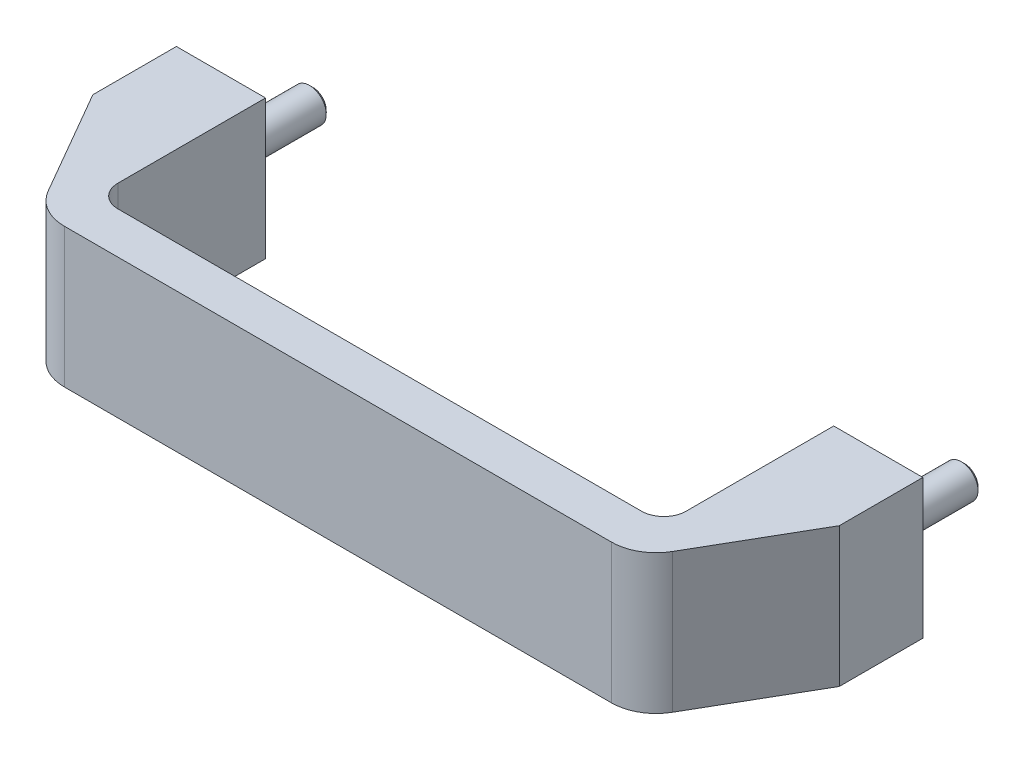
ISO-10303-21;
HEADER;
FILE_DESCRIPTION(('STEP AP214'),'2;1');
FILE_NAME('part.step','',(''),(''),'','','');
FILE_SCHEMA(('AUTOMOTIVE_DESIGN { 1 0 10303 214 1 1 1 1 }'));
ENDSEC;
DATA;
#1=APPLICATION_CONTEXT('core data for automotive mechanical design processes');
#2=APPLICATION_PROTOCOL_DEFINITION('international standard','automotive_design',2000,#1);
#3=PRODUCT_CONTEXT('',#1,'mechanical');
#4=PRODUCT('Part','Part','',(#3));
#5=PRODUCT_RELATED_PRODUCT_CATEGORY('part','',(#4));
#6=PRODUCT_DEFINITION_FORMATION('','',#4);
#7=PRODUCT_DEFINITION_CONTEXT('part definition',#1,'design');
#8=PRODUCT_DEFINITION('design','',#6,#7);
#9=PRODUCT_DEFINITION_SHAPE('','',#8);
#10=(LENGTH_UNIT() NAMED_UNIT(*) SI_UNIT(.MILLI.,.METRE.));
#11=(NAMED_UNIT(*) PLANE_ANGLE_UNIT() SI_UNIT($,.RADIAN.));
#12=(NAMED_UNIT(*) SI_UNIT($,.STERADIAN.) SOLID_ANGLE_UNIT());
#13=UNCERTAINTY_MEASURE_WITH_UNIT(LENGTH_MEASURE(1.E-05),#10,'distance_accuracy_value','');
#14=(GEOMETRIC_REPRESENTATION_CONTEXT(3) GLOBAL_UNCERTAINTY_ASSIGNED_CONTEXT((#13)) GLOBAL_UNIT_ASSIGNED_CONTEXT((#10,
#11,#12)) REPRESENTATION_CONTEXT('',''));
#15=CARTESIAN_POINT('',(0.,0.,0.));
#16=DIRECTION('',(0.,0.,1.));
#17=DIRECTION('',(1.,0.,0.));
#18=AXIS2_PLACEMENT_3D('',#15,#16,#17);
#19=CARTESIAN_POINT('',(2.4696551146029,-12.5,34.));
#20=DIRECTION('',(0.866025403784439,0.,-0.5));
#21=DIRECTION('',(0.5,0.,0.866025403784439));
#22=AXIS2_PLACEMENT_3D('',#19,#20,#21);
#23=PLANE('',#22);
#24=DIRECTION('',(-0.5,0.,-0.866025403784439));
#25=VECTOR('',#24,1.);
#26=CARTESIAN_POINT('',(2.4696551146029,12.5,34.));
#27=LINE('',#26,#25);
#28=CARTESIAN_POINT('',(2.4696551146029,12.5,34.));
#29=VERTEX_POINT('',#28);
#30=CARTESIAN_POINT('',(-8.5,12.5,15.));
#31=VERTEX_POINT('',#30);
#32=EDGE_CURVE('E148',#29,#31,#27,.T.);
#33=ORIENTED_EDGE('',*,*,#32,.T.);
#34=DIRECTION('',(0.,1.,0.));
#35=VECTOR('',#34,1.);
#36=CARTESIAN_POINT('',(-8.5,-12.5,15.));
#37=LINE('',#36,#35);
#38=CARTESIAN_POINT('',(-8.5,-12.5,15.));
#39=VERTEX_POINT('',#38);
#40=EDGE_CURVE('E205',#39,#31,#37,.T.);
#41=ORIENTED_EDGE('',*,*,#40,.F.);
#42=DIRECTION('',(-0.5,0.,-0.866025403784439));
#43=VECTOR('',#42,1.);
#44=CARTESIAN_POINT('',(2.4696551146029,-12.5,34.));
#45=LINE('',#44,#43);
#46=CARTESIAN_POINT('',(2.4696551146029,-12.5,34.));
#47=VERTEX_POINT('',#46);
#48=EDGE_CURVE('E178',#47,#39,#45,.T.);
#49=ORIENTED_EDGE('',*,*,#48,.F.);
#50=DIRECTION('',(0.,1.,0.));
#51=VECTOR('',#50,1.);
#52=CARTESIAN_POINT('',(2.4696551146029,-12.5,34.));
#53=LINE('',#52,#51);
#54=EDGE_CURVE('E144',#47,#29,#53,.T.);
#55=ORIENTED_EDGE('',*,*,#54,.T.);
#56=EDGE_LOOP('',(#33,#41,#49,#55));
#57=FACE_BOUND('',#56,.T.);
#58=ADVANCED_FACE('F14',(#57),#23,.F.);
#59=CARTESIAN_POINT('',(-8.5,-12.5,15.));
#60=DIRECTION('',(1.,0.,0.));
#61=DIRECTION('',(0.,1.,0.));
#62=AXIS2_PLACEMENT_3D('',#59,#60,#61);
#63=PLANE('',#62);
#64=DIRECTION('',(0.,0.,-1.));
#65=VECTOR('',#64,1.);
#66=CARTESIAN_POINT('',(-8.5,12.5,15.));
#67=LINE('',#66,#65);
#68=CARTESIAN_POINT('',(-8.5,12.5,0.));
#69=VERTEX_POINT('',#68);
#70=EDGE_CURVE('E151',#31,#69,#67,.T.);
#71=ORIENTED_EDGE('',*,*,#70,.T.);
#72=DIRECTION('',(0.,1.,0.));
#73=VECTOR('',#72,1.);
#74=CARTESIAN_POINT('',(-8.5,-12.5,0.));
#75=LINE('',#74,#73);
#76=CARTESIAN_POINT('',(-8.5,-12.5,0.));
#77=VERTEX_POINT('',#76);
#78=EDGE_CURVE('E202',#77,#69,#75,.T.);
#79=ORIENTED_EDGE('',*,*,#78,.F.);
#80=DIRECTION('',(0.,0.,-1.));
#81=VECTOR('',#80,1.);
#82=CARTESIAN_POINT('',(-8.5,-12.5,15.));
#83=LINE('',#82,#81);
#84=EDGE_CURVE('E93',#39,#77,#83,.T.);
#85=ORIENTED_EDGE('',*,*,#84,.F.);
#86=ORIENTED_EDGE('',*,*,#40,.T.);
#87=EDGE_LOOP('',(#71,#79,#85,#86));
#88=FACE_BOUND('',#87,.T.);
#89=ADVANCED_FACE('F234',(#88),#63,.F.);
#90=CARTESIAN_POINT('',(-8.5,-12.5,0.));
#91=DIRECTION('',(0.,0.,1.));
#92=DIRECTION('',(0.,-1.,0.));
#93=AXIS2_PLACEMENT_3D('',#90,#91,#92);
#94=PLANE('',#93);
#95=CARTESIAN_POINT('',(0.,0.,0.));
#96=DIRECTION('',(0.,0.,1.));
#97=DIRECTION('',(0.,-1.,0.));
#98=AXIS2_PLACEMENT_3D('',#95,#96,#97);
#99=CIRCLE('',#98,3.);
#100=CARTESIAN_POINT('',(0.,-3.,0.));
#101=VERTEX_POINT('',#100);
#102=EDGE_CURVE('E207',#101,#101,#99,.F.);
#103=ORIENTED_EDGE('',*,*,#102,.F.);
#104=EDGE_LOOP('',(#103));
#105=FACE_BOUND('',#104,.T.);
#106=DIRECTION('',(1.,0.,0.));
#107=VECTOR('',#106,1.);
#108=CARTESIAN_POINT('',(-8.5,12.5,0.));
#109=LINE('',#108,#107);
#110=CARTESIAN_POINT('',(7.5,12.5,0.));
#111=VERTEX_POINT('',#110);
#112=EDGE_CURVE('E153',#69,#111,#109,.T.);
#113=ORIENTED_EDGE('',*,*,#112,.T.);
#114=DIRECTION('',(0.,1.,0.));
#115=VECTOR('',#114,1.);
#116=CARTESIAN_POINT('',(7.5,-12.5,0.));
#117=LINE('',#116,#115);
#118=CARTESIAN_POINT('',(7.5,-12.5,0.));
#119=VERTEX_POINT('',#118);
#120=EDGE_CURVE('E199',#119,#111,#117,.T.);
#121=ORIENTED_EDGE('',*,*,#120,.F.);
#122=DIRECTION('',(1.,0.,0.));
#123=VECTOR('',#122,1.);
#124=CARTESIAN_POINT('',(-8.5,-12.5,0.));
#125=LINE('',#124,#123);
#126=EDGE_CURVE('E470',#77,#119,#125,.T.);
#127=ORIENTED_EDGE('',*,*,#126,.F.);
#128=ORIENTED_EDGE('',*,*,#78,.T.);
#129=EDGE_LOOP('',(#113,#121,#127,#128));
#130=FACE_BOUND('',#129,.T.);
#131=ADVANCED_FACE('F240',(#105,#130),#94,.F.);
#132=CARTESIAN_POINT('',(7.5,-12.5,0.));
#133=DIRECTION('',(-1.,0.,0.));
#134=DIRECTION('',(0.,-1.,0.));
#135=AXIS2_PLACEMENT_3D('',#132,#133,#134);
#136=PLANE('',#135);
#137=DIRECTION('',(0.,0.,1.));
#138=VECTOR('',#137,1.);
#139=CARTESIAN_POINT('',(7.5,12.5,0.));
#140=LINE('',#139,#138);
#141=CARTESIAN_POINT('',(7.5,12.5,26.5));
#142=VERTEX_POINT('',#141);
#143=EDGE_CURVE('E155',#111,#142,#140,.T.);
#144=ORIENTED_EDGE('',*,*,#143,.T.);
#145=DIRECTION('',(0.,1.,0.));
#146=VECTOR('',#145,1.);
#147=CARTESIAN_POINT('',(7.5,-12.5,26.5));
#148=LINE('',#147,#146);
#149=CARTESIAN_POINT('',(7.5,-12.5,26.5));
#150=VERTEX_POINT('',#149);
#151=EDGE_CURVE('E197',#150,#142,#148,.T.);
#152=ORIENTED_EDGE('',*,*,#151,.F.);
#153=DIRECTION('',(0.,0.,1.));
#154=VECTOR('',#153,1.);
#155=CARTESIAN_POINT('',(7.5,-12.5,0.));
#156=LINE('',#155,#154);
#157=EDGE_CURVE('E468',#119,#150,#156,.T.);
#158=ORIENTED_EDGE('',*,*,#157,.F.);
#159=ORIENTED_EDGE('',*,*,#120,.T.);
#160=EDGE_LOOP('',(#144,#152,#158,#159));
#161=FACE_BOUND('',#160,.T.);
#162=ADVANCED_FACE('F245',(#161),#136,.F.);
#163=CARTESIAN_POINT('',(11.5,-12.5,26.5));
#164=DIRECTION('',(0.,1.,0.));
#165=DIRECTION('',(-1.,0.,0.));
#166=AXIS2_PLACEMENT_3D('',#163,#164,#165);
#167=CYLINDRICAL_SURFACE('',#166,4.);
#168=CARTESIAN_POINT('',(11.5,12.5,26.5));
#169=DIRECTION('',(0.,-1.,0.));
#170=DIRECTION('',(1.,0.,0.));
#171=AXIS2_PLACEMENT_3D('',#168,#169,#170);
#172=CIRCLE('',#171,4.);
#173=CARTESIAN_POINT('',(11.5,12.5,30.5));
#174=VERTEX_POINT('',#173);
#175=EDGE_CURVE('E158',#174,#142,#172,.T.);
#176=ORIENTED_EDGE('',*,*,#175,.F.);
#177=DIRECTION('',(0.,1.,0.));
#178=VECTOR('',#177,1.);
#179=CARTESIAN_POINT('',(11.5,-12.5,30.5));
#180=LINE('',#179,#178);
#181=CARTESIAN_POINT('',(11.5,-12.5,30.5));
#182=VERTEX_POINT('',#181);
#183=EDGE_CURVE('E195',#182,#174,#180,.T.);
#184=ORIENTED_EDGE('',*,*,#183,.F.);
#185=CARTESIAN_POINT('',(11.5,-12.5,26.5));
#186=DIRECTION('',(0.,-1.,0.));
#187=DIRECTION('',(1.,0.,0.));
#188=AXIS2_PLACEMENT_3D('',#185,#186,#187);
#189=CIRCLE('',#188,4.);
#190=EDGE_CURVE('E465',#182,#150,#189,.T.);
#191=ORIENTED_EDGE('',*,*,#190,.T.);
#192=ORIENTED_EDGE('',*,*,#151,.T.);
#193=EDGE_LOOP('',(#176,#184,#191,#192));
#194=FACE_BOUND('',#193,.T.);
#195=ADVANCED_FACE('F249',(#194),#167,.F.);
#196=CARTESIAN_POINT('',(11.5,-12.5,30.5));
#197=DIRECTION('',(0.,0.,1.));
#198=DIRECTION('',(0.,-1.,0.));
#199=AXIS2_PLACEMENT_3D('',#196,#197,#198);
#200=PLANE('',#199);
#201=DIRECTION('',(1.,0.,0.));
#202=VECTOR('',#201,1.);
#203=CARTESIAN_POINT('',(11.5,12.5,30.5));
#204=LINE('',#203,#202);
#205=CARTESIAN_POINT('',(105.5,12.5,30.5));
#206=VERTEX_POINT('',#205);
#207=EDGE_CURVE('E161',#174,#206,#204,.T.);
#208=ORIENTED_EDGE('',*,*,#207,.T.);
#209=DIRECTION('',(0.,1.,0.));
#210=VECTOR('',#209,1.);
#211=CARTESIAN_POINT('',(105.5,-12.5,30.5));
#212=LINE('',#211,#210);
#213=CARTESIAN_POINT('',(105.5,-12.5,30.5));
#214=VERTEX_POINT('',#213);
#215=EDGE_CURVE('E193',#214,#206,#212,.T.);
#216=ORIENTED_EDGE('',*,*,#215,.F.);
#217=DIRECTION('',(1.,0.,0.));
#218=VECTOR('',#217,1.);
#219=CARTESIAN_POINT('',(11.5,-12.5,30.5));
#220=LINE('',#219,#218);
#221=EDGE_CURVE('E463',#182,#214,#220,.T.);
#222=ORIENTED_EDGE('',*,*,#221,.F.);
#223=ORIENTED_EDGE('',*,*,#183,.T.);
#224=EDGE_LOOP('',(#208,#216,#222,#223));
#225=FACE_BOUND('',#224,.T.);
#226=ADVANCED_FACE('F253',(#225),#200,.F.);
#227=CARTESIAN_POINT('',(105.5,-12.5,26.5));
#228=DIRECTION('',(0.,1.,0.));
#229=DIRECTION('',(-1.,0.,0.));
#230=AXIS2_PLACEMENT_3D('',#227,#228,#229);
#231=CYLINDRICAL_SURFACE('',#230,4.);
#232=CARTESIAN_POINT('',(105.5,12.5,26.5));
#233=DIRECTION('',(0.,-1.,0.));
#234=DIRECTION('',(1.,0.,0.));
#235=AXIS2_PLACEMENT_3D('',#232,#233,#234);
#236=CIRCLE('',#235,4.);
#237=CARTESIAN_POINT('',(109.5,12.5,26.5));
#238=VERTEX_POINT('',#237);
#239=EDGE_CURVE('E164',#238,#206,#236,.T.);
#240=ORIENTED_EDGE('',*,*,#239,.F.);
#241=DIRECTION('',(0.,1.,0.));
#242=VECTOR('',#241,1.);
#243=CARTESIAN_POINT('',(109.5,-12.5,26.5));
#244=LINE('',#243,#242);
#245=CARTESIAN_POINT('',(109.5,-12.5,26.5));
#246=VERTEX_POINT('',#245);
#247=EDGE_CURVE('E191',#246,#238,#244,.T.);
#248=ORIENTED_EDGE('',*,*,#247,.F.);
#249=CARTESIAN_POINT('',(105.5,-12.5,26.5));
#250=DIRECTION('',(0.,-1.,0.));
#251=DIRECTION('',(1.,0.,0.));
#252=AXIS2_PLACEMENT_3D('',#249,#250,#251);
#253=CIRCLE('',#252,4.);
#254=EDGE_CURVE('E460',#246,#214,#253,.T.);
#255=ORIENTED_EDGE('',*,*,#254,.T.);
#256=ORIENTED_EDGE('',*,*,#215,.T.);
#257=EDGE_LOOP('',(#240,#248,#255,#256));
#258=FACE_BOUND('',#257,.T.);
#259=ADVANCED_FACE('F257',(#258),#231,.F.);
#260=CARTESIAN_POINT('',(109.5,-12.5,26.5));
#261=DIRECTION('',(1.,0.,0.));
#262=DIRECTION('',(0.,1.,0.));
#263=AXIS2_PLACEMENT_3D('',#260,#261,#262);
#264=PLANE('',#263);
#265=DIRECTION('',(0.,0.,-1.));
#266=VECTOR('',#265,1.);
#267=CARTESIAN_POINT('',(109.5,12.5,26.5));
#268=LINE('',#267,#266);
#269=CARTESIAN_POINT('',(109.5,12.5,0.));
#270=VERTEX_POINT('',#269);
#271=EDGE_CURVE('E167',#238,#270,#268,.T.);
#272=ORIENTED_EDGE('',*,*,#271,.T.);
#273=DIRECTION('',(0.,1.,0.));
#274=VECTOR('',#273,1.);
#275=CARTESIAN_POINT('',(109.5,-12.5,0.));
#276=LINE('',#275,#274);
#277=CARTESIAN_POINT('',(109.5,-12.5,0.));
#278=VERTEX_POINT('',#277);
#279=EDGE_CURVE('E188',#278,#270,#276,.T.);
#280=ORIENTED_EDGE('',*,*,#279,.F.);
#281=DIRECTION('',(0.,0.,-1.));
#282=VECTOR('',#281,1.);
#283=CARTESIAN_POINT('',(109.5,-12.5,26.5));
#284=LINE('',#283,#282);
#285=EDGE_CURVE('E458',#246,#278,#284,.T.);
#286=ORIENTED_EDGE('',*,*,#285,.F.);
#287=ORIENTED_EDGE('',*,*,#247,.T.);
#288=EDGE_LOOP('',(#272,#280,#286,#287));
#289=FACE_BOUND('',#288,.T.);
#290=ADVANCED_FACE('F261',(#289),#264,.F.);
#291=CARTESIAN_POINT('',(109.5,-12.5,0.));
#292=DIRECTION('',(0.,0.,1.));
#293=DIRECTION('',(0.,-1.,0.));
#294=AXIS2_PLACEMENT_3D('',#291,#292,#293);
#295=PLANE('',#294);
#296=CARTESIAN_POINT('',(117.,0.,0.));
#297=DIRECTION('',(0.,0.,1.));
#298=DIRECTION('',(0.,-1.,0.));
#299=AXIS2_PLACEMENT_3D('',#296,#297,#298);
#300=CIRCLE('',#299,3.);
#301=CARTESIAN_POINT('',(117.,-3.,0.));
#302=VERTEX_POINT('',#301);
#303=EDGE_CURVE('E210',#302,#302,#300,.F.);
#304=ORIENTED_EDGE('',*,*,#303,.F.);
#305=EDGE_LOOP('',(#304));
#306=FACE_BOUND('',#305,.T.);
#307=DIRECTION('',(1.,0.,0.));
#308=VECTOR('',#307,1.);
#309=CARTESIAN_POINT('',(109.5,12.5,0.));
#310=LINE('',#309,#308);
#311=CARTESIAN_POINT('',(125.5,12.5,0.));
#312=VERTEX_POINT('',#311);
#313=EDGE_CURVE('E169',#270,#312,#310,.T.);
#314=ORIENTED_EDGE('',*,*,#313,.T.);
#315=DIRECTION('',(0.,1.,0.));
#316=VECTOR('',#315,1.);
#317=CARTESIAN_POINT('',(125.5,-12.5,0.));
#318=LINE('',#317,#316);
#319=CARTESIAN_POINT('',(125.5,-12.5,0.));
#320=VERTEX_POINT('',#319);
#321=EDGE_CURVE('E185',#320,#312,#318,.T.);
#322=ORIENTED_EDGE('',*,*,#321,.F.);
#323=DIRECTION('',(1.,0.,0.));
#324=VECTOR('',#323,1.);
#325=CARTESIAN_POINT('',(109.5,-12.5,0.));
#326=LINE('',#325,#324);
#327=EDGE_CURVE('E454',#278,#320,#326,.T.);
#328=ORIENTED_EDGE('',*,*,#327,.F.);
#329=ORIENTED_EDGE('',*,*,#279,.T.);
#330=EDGE_LOOP('',(#314,#322,#328,#329));
#331=FACE_BOUND('',#330,.T.);
#332=ADVANCED_FACE('F265',(#306,#331),#295,.F.);
#333=CARTESIAN_POINT('',(125.5,-12.5,0.));
#334=DIRECTION('',(-1.,0.,0.));
#335=DIRECTION('',(0.,-1.,0.));
#336=AXIS2_PLACEMENT_3D('',#333,#334,#335);
#337=PLANE('',#336);
#338=DIRECTION('',(0.,0.,1.));
#339=VECTOR('',#338,1.);
#340=CARTESIAN_POINT('',(125.5,12.5,0.));
#341=LINE('',#340,#339);
#342=CARTESIAN_POINT('',(125.5,12.5,15.));
#343=VERTEX_POINT('',#342);
#344=EDGE_CURVE('E171',#312,#343,#341,.T.);
#345=ORIENTED_EDGE('',*,*,#344,.T.);
#346=DIRECTION('',(0.,1.,0.));
#347=VECTOR('',#346,1.);
#348=CARTESIAN_POINT('',(125.5,-12.5,15.));
#349=LINE('',#348,#347);
#350=CARTESIAN_POINT('',(125.5,-12.5,15.));
#351=VERTEX_POINT('',#350);
#352=EDGE_CURVE('E182',#351,#343,#349,.T.);
#353=ORIENTED_EDGE('',*,*,#352,.F.);
#354=DIRECTION('',(0.,0.,1.));
#355=VECTOR('',#354,1.);
#356=CARTESIAN_POINT('',(125.5,-12.5,0.));
#357=LINE('',#356,#355);
#358=EDGE_CURVE('E451',#320,#351,#357,.T.);
#359=ORIENTED_EDGE('',*,*,#358,.F.);
#360=ORIENTED_EDGE('',*,*,#321,.T.);
#361=EDGE_LOOP('',(#345,#353,#359,#360));
#362=FACE_BOUND('',#361,.T.);
#363=ADVANCED_FACE('F269',(#362),#337,.F.);
#364=CARTESIAN_POINT('',(125.5,-12.5,15.));
#365=DIRECTION('',(-0.866025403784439,0.,-0.5));
#366=DIRECTION('',(0.5,0.,-0.866025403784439));
#367=AXIS2_PLACEMENT_3D('',#364,#365,#366);
#368=PLANE('',#367);
#369=DIRECTION('',(-0.5,0.,0.866025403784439));
#370=VECTOR('',#369,1.);
#371=CARTESIAN_POINT('',(125.5,12.5,15.));
#372=LINE('',#371,#370);
#373=CARTESIAN_POINT('',(114.530344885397,12.5,34.));
#374=VERTEX_POINT('',#373);
#375=EDGE_CURVE('E173',#343,#374,#372,.T.);
#376=ORIENTED_EDGE('',*,*,#375,.T.);
#377=DIRECTION('',(0.,1.,0.));
#378=VECTOR('',#377,1.);
#379=CARTESIAN_POINT('',(114.530344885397,-12.5,34.));
#380=LINE('',#379,#378);
#381=CARTESIAN_POINT('',(114.530344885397,-12.5,34.));
#382=VERTEX_POINT('',#381);
#383=EDGE_CURVE('E139',#382,#374,#380,.T.);
#384=ORIENTED_EDGE('',*,*,#383,.F.);
#385=DIRECTION('',(-0.5,0.,0.866025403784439));
#386=VECTOR('',#385,1.);
#387=CARTESIAN_POINT('',(125.5,-12.5,15.));
#388=LINE('',#387,#386);
#389=EDGE_CURVE('E130',#351,#382,#388,.T.);
#390=ORIENTED_EDGE('',*,*,#389,.F.);
#391=ORIENTED_EDGE('',*,*,#352,.T.);
#392=EDGE_LOOP('',(#376,#384,#390,#391));
#393=FACE_BOUND('',#392,.T.);
#394=ADVANCED_FACE('F273',(#393),#368,.F.);
#395=CARTESIAN_POINT('',(107.602141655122,-12.5,30.));
#396=DIRECTION('',(0.,1.,0.));
#397=DIRECTION('',(-1.,0.,0.));
#398=AXIS2_PLACEMENT_3D('',#395,#396,#397);
#399=CYLINDRICAL_SURFACE('',#398,8.);
#400=CARTESIAN_POINT('',(107.602141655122,12.5,30.));
#401=DIRECTION('',(0.,-1.,0.));
#402=DIRECTION('',(1.,0.,0.));
#403=AXIS2_PLACEMENT_3D('',#400,#401,#402);
#404=CIRCLE('',#403,8.);
#405=CARTESIAN_POINT('',(107.602141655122,12.5,38.));
#406=VERTEX_POINT('',#405);
#407=EDGE_CURVE('E138',#374,#406,#404,.T.);
#408=ORIENTED_EDGE('',*,*,#407,.T.);
#409=DIRECTION('',(0.,1.,0.));
#410=VECTOR('',#409,1.);
#411=CARTESIAN_POINT('',(107.602141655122,-12.5,38.));
#412=LINE('',#411,#410);
#413=CARTESIAN_POINT('',(107.602141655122,-12.5,38.));
#414=VERTEX_POINT('',#413);
#415=EDGE_CURVE('E135',#414,#406,#412,.T.);
#416=ORIENTED_EDGE('',*,*,#415,.F.);
#417=CARTESIAN_POINT('',(107.602141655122,-12.5,30.));
#418=DIRECTION('',(0.,-1.,0.));
#419=DIRECTION('',(1.,0.,0.));
#420=AXIS2_PLACEMENT_3D('',#417,#418,#419);
#421=CIRCLE('',#420,8.);
#422=EDGE_CURVE('E124',#382,#414,#421,.T.);
#423=ORIENTED_EDGE('',*,*,#422,.F.);
#424=ORIENTED_EDGE('',*,*,#383,.T.);
#425=EDGE_LOOP('',(#408,#416,#423,#424));
#426=FACE_BOUND('',#425,.T.);
#427=ADVANCED_FACE('F136',(#426),#399,.T.);
#428=CARTESIAN_POINT('',(107.602141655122,-12.5,38.));
#429=DIRECTION('',(0.,0.,-1.));
#430=DIRECTION('',(0.,1.,0.));
#431=AXIS2_PLACEMENT_3D('',#428,#429,#430);
#432=PLANE('',#431);
#433=DIRECTION('',(-1.,0.,0.));
#434=VECTOR('',#433,1.);
#435=CARTESIAN_POINT('',(107.602141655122,12.5,38.));
#436=LINE('',#435,#434);
#437=CARTESIAN_POINT('',(9.3978583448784,12.5,38.));
#438=VERTEX_POINT('',#437);
#439=EDGE_CURVE('E78',#406,#438,#436,.T.);
#440=ORIENTED_EDGE('',*,*,#439,.T.);
#441=DIRECTION('',(0.,1.,0.));
#442=VECTOR('',#441,1.);
#443=CARTESIAN_POINT('',(9.3978583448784,-12.5,38.));
#444=LINE('',#443,#442);
#445=CARTESIAN_POINT('',(9.3978583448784,-12.5,38.));
#446=VERTEX_POINT('',#445);
#447=EDGE_CURVE('E140',#446,#438,#444,.T.);
#448=ORIENTED_EDGE('',*,*,#447,.F.);
#449=DIRECTION('',(-1.,0.,0.));
#450=VECTOR('',#449,1.);
#451=CARTESIAN_POINT('',(107.602141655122,-12.5,38.));
#452=LINE('',#451,#450);
#453=EDGE_CURVE('E128',#414,#446,#452,.T.);
#454=ORIENTED_EDGE('',*,*,#453,.F.);
#455=ORIENTED_EDGE('',*,*,#415,.T.);
#456=EDGE_LOOP('',(#440,#448,#454,#455));
#457=FACE_BOUND('',#456,.T.);
#458=ADVANCED_FACE('F142',(#457),#432,.F.);
#459=CARTESIAN_POINT('',(9.3978583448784,-12.5,30.));
#460=DIRECTION('',(0.,1.,0.));
#461=DIRECTION('',(-1.,0.,0.));
#462=AXIS2_PLACEMENT_3D('',#459,#460,#461);
#463=CYLINDRICAL_SURFACE('',#462,8.);
#464=CARTESIAN_POINT('',(9.3978583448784,12.5,30.));
#465=DIRECTION('',(0.,-1.,0.));
#466=DIRECTION('',(1.,0.,0.));
#467=AXIS2_PLACEMENT_3D('',#464,#465,#466);
#468=CIRCLE('',#467,8.);
#469=EDGE_CURVE('E84',#438,#29,#468,.T.);
#470=ORIENTED_EDGE('',*,*,#469,.T.);
#471=ORIENTED_EDGE('',*,*,#54,.F.);
#472=CARTESIAN_POINT('',(9.3978583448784,-12.5,30.));
#473=DIRECTION('',(0.,-1.,0.));
#474=DIRECTION('',(1.,0.,0.));
#475=AXIS2_PLACEMENT_3D('',#472,#473,#474);
#476=CIRCLE('',#475,8.);
#477=EDGE_CURVE('E31',#446,#47,#476,.T.);
#478=ORIENTED_EDGE('',*,*,#477,.F.);
#479=ORIENTED_EDGE('',*,*,#447,.T.);
#480=EDGE_LOOP('',(#470,#471,#478,#479));
#481=FACE_BOUND('',#480,.T.);
#482=ADVANCED_FACE('F282',(#481),#463,.T.);
#483=CARTESIAN_POINT('',(11.5,-12.5,26.5));
#484=DIRECTION('',(0.,-1.,0.));
#485=DIRECTION('',(1.,0.,0.));
#486=AXIS2_PLACEMENT_3D('',#483,#484,#485);
#487=PLANE('',#486);
#488=ORIENTED_EDGE('',*,*,#48,.T.);
#489=ORIENTED_EDGE('',*,*,#84,.T.);
#490=ORIENTED_EDGE('',*,*,#126,.T.);
#491=ORIENTED_EDGE('',*,*,#157,.T.);
#492=ORIENTED_EDGE('',*,*,#190,.F.);
#493=ORIENTED_EDGE('',*,*,#221,.T.);
#494=ORIENTED_EDGE('',*,*,#254,.F.);
#495=ORIENTED_EDGE('',*,*,#285,.T.);
#496=ORIENTED_EDGE('',*,*,#327,.T.);
#497=ORIENTED_EDGE('',*,*,#358,.T.);
#498=ORIENTED_EDGE('',*,*,#389,.T.);
#499=ORIENTED_EDGE('',*,*,#422,.T.);
#500=ORIENTED_EDGE('',*,*,#453,.T.);
#501=ORIENTED_EDGE('',*,*,#477,.T.);
#502=EDGE_LOOP('',(#488,#489,#490,#491,#492,#493,#494,#495,#496,#497,#498,#499,#500,#501));
#503=FACE_BOUND('',#502,.T.);
#504=ADVANCED_FACE('F126',(#503),#487,.T.);
#505=CARTESIAN_POINT('',(11.5,12.5,26.5));
#506=DIRECTION('',(0.,-1.,0.));
#507=DIRECTION('',(1.,0.,0.));
#508=AXIS2_PLACEMENT_3D('',#505,#506,#507);
#509=PLANE('',#508);
#510=ORIENTED_EDGE('',*,*,#32,.F.);
#511=ORIENTED_EDGE('',*,*,#469,.F.);
#512=ORIENTED_EDGE('',*,*,#439,.F.);
#513=ORIENTED_EDGE('',*,*,#407,.F.);
#514=ORIENTED_EDGE('',*,*,#375,.F.);
#515=ORIENTED_EDGE('',*,*,#344,.F.);
#516=ORIENTED_EDGE('',*,*,#313,.F.);
#517=ORIENTED_EDGE('',*,*,#271,.F.);
#518=ORIENTED_EDGE('',*,*,#239,.T.);
#519=ORIENTED_EDGE('',*,*,#207,.F.);
#520=ORIENTED_EDGE('',*,*,#175,.T.);
#521=ORIENTED_EDGE('',*,*,#143,.F.);
#522=ORIENTED_EDGE('',*,*,#112,.F.);
#523=ORIENTED_EDGE('',*,*,#70,.F.);
#524=EDGE_LOOP('',(#510,#511,#512,#513,#514,#515,#516,#517,#518,#519,#520,#521,#522,#523));
#525=FACE_BOUND('',#524,.T.);
#526=ADVANCED_FACE('F285',(#525),#509,.F.);
#527=CARTESIAN_POINT('',(0.,0.,-12.));
#528=DIRECTION('',(0.,0.,-1.));
#529=DIRECTION('',(0.,1.,0.));
#530=AXIS2_PLACEMENT_3D('',#527,#528,#529);
#531=CYLINDRICAL_SURFACE('',#530,3.);
#532=CARTESIAN_POINT('',(0.,0.,-15.4));
#533=DIRECTION('',(0.,0.,-1.));
#534=DIRECTION('',(-1.,0.,0.));
#535=AXIS2_PLACEMENT_3D('',#532,#533,#534);
#536=CIRCLE('',#535,3.);
#537=CARTESIAN_POINT('',(-3.,0.,-15.4));
#538=VERTEX_POINT('',#537);
#539=EDGE_CURVE('E216',#538,#538,#536,.F.);
#540=ORIENTED_EDGE('',*,*,#539,.T.);
#541=EDGE_LOOP('',(#540));
#542=FACE_BOUND('',#541,.T.);
#543=ORIENTED_EDGE('',*,*,#102,.T.);
#544=EDGE_LOOP('',(#543));
#545=FACE_BOUND('',#544,.T.);
#546=ADVANCED_FACE('F288',(#542,#545),#531,.T.);
#547=CARTESIAN_POINT('',(117.,0.,-12.));
#548=DIRECTION('',(0.,0.,-1.));
#549=DIRECTION('',(0.,1.,0.));
#550=AXIS2_PLACEMENT_3D('',#547,#548,#549);
#551=CYLINDRICAL_SURFACE('',#550,3.);
#552=CARTESIAN_POINT('',(117.,0.,-15.4));
#553=DIRECTION('',(0.,0.,-1.));
#554=DIRECTION('',(-1.,0.,0.));
#555=AXIS2_PLACEMENT_3D('',#552,#553,#554);
#556=CIRCLE('',#555,3.);
#557=CARTESIAN_POINT('',(114.,0.,-15.4));
#558=VERTEX_POINT('',#557);
#559=EDGE_CURVE('E9',#558,#558,#556,.F.);
#560=ORIENTED_EDGE('',*,*,#559,.T.);
#561=EDGE_LOOP('',(#560));
#562=FACE_BOUND('',#561,.T.);
#563=ORIENTED_EDGE('',*,*,#303,.T.);
#564=EDGE_LOOP('',(#563));
#565=FACE_BOUND('',#564,.T.);
#566=ADVANCED_FACE('F294',(#562,#565),#551,.T.);
#567=CARTESIAN_POINT('',(117.,0.,-16.));
#568=DIRECTION('',(0.,0.,-1.));
#569=DIRECTION('',(-1.,0.,0.));
#570=AXIS2_PLACEMENT_3D('',#567,#568,#569);
#571=PLANE('',#570);
#572=CARTESIAN_POINT('',(117.,0.,-16.));
#573=DIRECTION('',(0.,0.,-1.));
#574=DIRECTION('',(-1.,0.,0.));
#575=AXIS2_PLACEMENT_3D('',#572,#573,#574);
#576=CIRCLE('',#575,2.4);
#577=CARTESIAN_POINT('',(114.6,0.,-16.));
#578=VERTEX_POINT('',#577);
#579=EDGE_CURVE('E23',#578,#578,#576,.T.);
#580=ORIENTED_EDGE('',*,*,#579,.T.);
#581=EDGE_LOOP('',(#580));
#582=FACE_BOUND('',#581,.T.);
#583=ADVANCED_FACE('F221',(#582),#571,.T.);
#584=CARTESIAN_POINT('',(0.,0.,-16.));
#585=DIRECTION('',(0.,0.,-1.));
#586=DIRECTION('',(-1.,0.,0.));
#587=AXIS2_PLACEMENT_3D('',#584,#585,#586);
#588=PLANE('',#587);
#589=CARTESIAN_POINT('',(0.,0.,-16.));
#590=DIRECTION('',(0.,0.,-1.));
#591=DIRECTION('',(-1.,0.,0.));
#592=AXIS2_PLACEMENT_3D('',#589,#590,#591);
#593=CIRCLE('',#592,2.4);
#594=CARTESIAN_POINT('',(-2.4,0.,-16.));
#595=VERTEX_POINT('',#594);
#596=EDGE_CURVE('E213',#595,#595,#593,.T.);
#597=ORIENTED_EDGE('',*,*,#596,.T.);
#598=EDGE_LOOP('',(#597));
#599=FACE_BOUND('',#598,.T.);
#600=ADVANCED_FACE('F230',(#599),#588,.T.);
#601=CARTESIAN_POINT('',(0.,0.,-16.));
#602=DIRECTION('',(0.,0.,1.));
#603=DIRECTION('',(1.,0.,0.));
#604=AXIS2_PLACEMENT_3D('',#601,#602,#603);
#605=CONICAL_SURFACE('',#604,2.4,0.785398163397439);
#606=ORIENTED_EDGE('',*,*,#539,.F.);
#607=EDGE_LOOP('',(#606));
#608=FACE_BOUND('',#607,.T.);
#609=ORIENTED_EDGE('',*,*,#596,.F.);
#610=EDGE_LOOP('',(#609));
#611=FACE_BOUND('',#610,.T.);
#612=ADVANCED_FACE('F224',(#608,#611),#605,.T.);
#613=CARTESIAN_POINT('',(117.,0.,-16.));
#614=DIRECTION('',(0.,0.,1.));
#615=DIRECTION('',(1.,0.,0.));
#616=AXIS2_PLACEMENT_3D('',#613,#614,#615);
#617=CONICAL_SURFACE('',#616,2.4,0.785398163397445);
#618=ORIENTED_EDGE('',*,*,#559,.F.);
#619=EDGE_LOOP('',(#618));
#620=FACE_BOUND('',#619,.T.);
#621=ORIENTED_EDGE('',*,*,#579,.F.);
#622=EDGE_LOOP('',(#621));
#623=FACE_BOUND('',#622,.T.);
#624=ADVANCED_FACE('F16',(#620,#623),#617,.T.);
#625=CLOSED_SHELL('',(#58,#89,#131,#162,#195,#226,#259,#290,#332,#363,#394,#427,#458,#482,#504,
#526,#546,#566,#583,#600,#612,#624));
#626=MANIFOLD_SOLID_BREP('B1',#625);
#627=ADVANCED_BREP_SHAPE_REPRESENTATION('',(#18,#626),#14);
#628=SHAPE_DEFINITION_REPRESENTATION(#9,#627);
ENDSEC;
END-ISO-10303-21;
